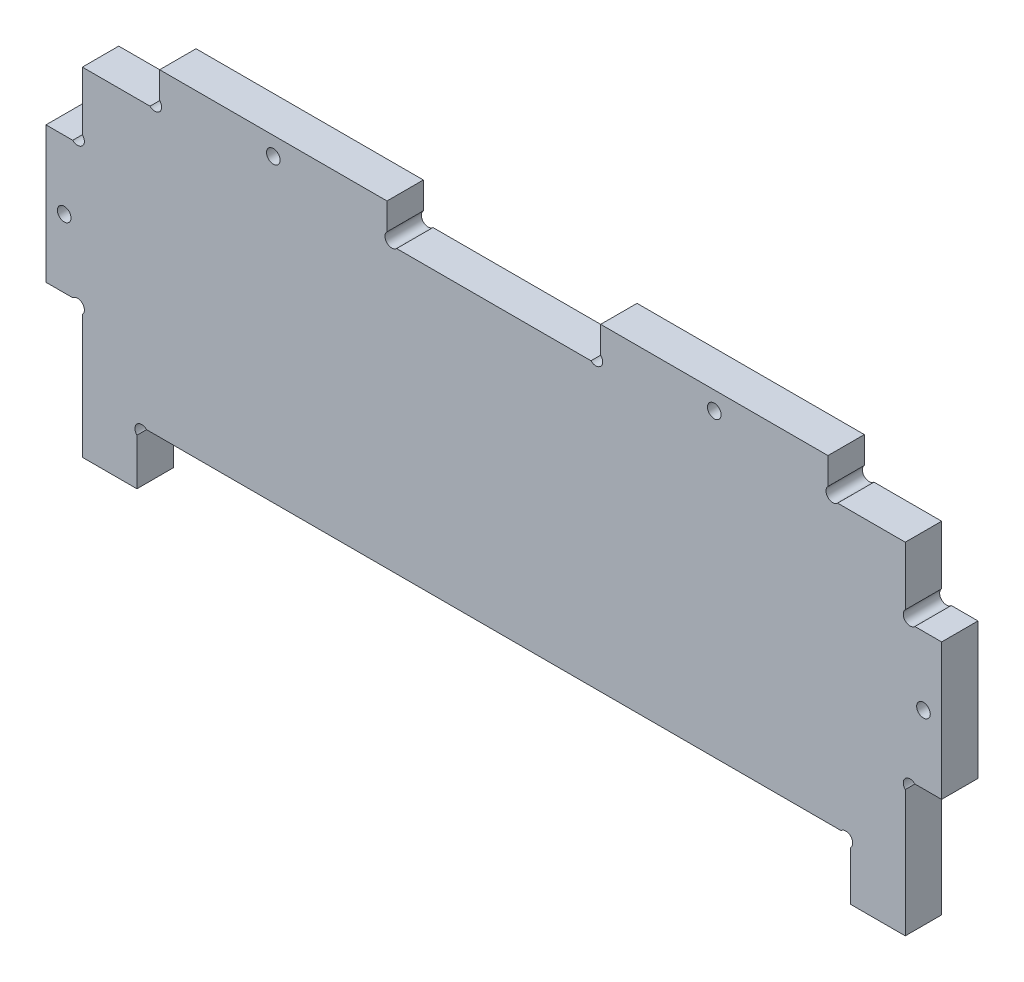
from build123d import *

# Parameters (mm, degrees)
ESQUISSE1_R        = 1.5
BOSS_EXTRU_1_DEPTH = 8


with BuildPart() as part:
    # Esquisse1 → Boss.-Extru.1 (new body)
    with BuildSketch(Plane.XY):
        with BuildLine():
            Line((-38.164401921, 25.463289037), (-23.285722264, 25.463289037))
            ThreePointArc((-23.285722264, 25.463289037), (-21.164401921, 25.463289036), (-21.16440192, 27.584609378))
            Line((-21.16440192, 27.584609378), (-21.16440192, 33.463289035))
            Line((-21.16440192, 33.463289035), (28.83559808, 33.463289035))
            Line((28.83559808, 33.463289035), (28.83559808, 27.584609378))
            ThreePointArc((28.83559808, 27.584609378), (28.83559808, 25.463289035), (30.956918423, 25.463289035))
            Line((30.956918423, 25.463289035), (73.714277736, 25.463289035))
            ThreePointArc((73.714277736, 25.463289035), (75.835598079, 25.463289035), (75.835598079, 27.584609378))
            Line((75.835598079, 27.584609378), (75.835598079, 33.463289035))
            Line((75.835598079, 33.463289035), (125.835598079, 33.463289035))
            Line((125.835598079, 33.463289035), (125.835598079, 27.584609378))
            ThreePointArc((125.835598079, 27.584609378), (125.83559808, 25.463289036), (127.956918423, 25.463289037))
            Line((127.956918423, 25.463289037), (142.835598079, 25.463289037))
            Line((142.835598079, 25.463289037), (142.835598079, 13.023949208))
            Line((142.835598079, 13.023949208), (142.835598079, 12.58460938))
            ThreePointArc((142.835598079, 12.58460938), (142.83559808, 10.463289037), (144.956918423, 10.463289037))
            Line((144.956918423, 10.463289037), (150.835598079, 10.463289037))
            Line((150.835598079, 10.463289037), (150.835598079, -19.536710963))
            Line((150.835598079, -19.536710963), (144.956918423, -19.536710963))
            ThreePointArc((144.956918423, -19.536710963), (142.835598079, -19.536710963), (142.835598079, -21.658031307))
            Line((142.835598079, -21.658031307), (142.835598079, -22.097371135))
            Line((142.835598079, -22.097371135), (142.835598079, -36.536710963))
            Line((142.835598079, -36.536710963), (142.835598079, -49.536710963))
            Line((142.835598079, -49.536710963), (130.835598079, -49.536710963))
            Line((130.835598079, -49.536710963), (130.835598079, -38.658031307))
            ThreePointArc((130.835598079, -38.658031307), (130.835598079, -36.536710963), (128.714277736, -36.536710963))
            Line((128.714277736, -36.536710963), (-24.043081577, -36.536710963))
            ThreePointArc((-24.043081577, -36.536710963), (-26.16440192, -36.536710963), (-26.16440192, -38.658031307))
            Line((-26.16440192, -38.658031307), (-26.16440192, -48.869271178))
            Line((-26.16440192, -48.869271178), (-38.16440192, -48.869271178))
            Line((-38.16440192, -48.869271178), (-38.16440192, -36.536710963))
            Line((-38.16440192, -36.536710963), (-38.16440192, -22.097371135))
            Line((-38.16440192, -22.097371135), (-38.16440192, -21.658031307))
            ThreePointArc((-38.16440192, -21.658031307), (-38.16440192, -19.536710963), (-40.285722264, -19.536710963))
            Line((-40.285722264, -19.536710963), (-46.164401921, -19.536710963))
            Line((-46.164401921, -19.536710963), (-46.164401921, 10.463289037))
            Line((-46.164401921, 10.463289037), (-40.285722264, 10.463289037))
            ThreePointArc((-40.285722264, 10.463289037), (-38.164401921, 10.463289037), (-38.164401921, 12.58460938))
            Line((-38.164401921, 12.58460938), (-38.164401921, 13.023949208))
            Line((-38.164401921, 13.023949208), (-38.164401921, 25.463289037))
        make_face()
        with Locations(Location((100.835598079, 29.463289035, 0), (0, 0, 180))):
            Circle(ESQUISSE1_R, mode=Mode.SUBTRACT)
        with Locations(Location((146.835598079, -4.536710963, 0), (0, 0, 180))):
            Circle(ESQUISSE1_R, mode=Mode.SUBTRACT)
        with Locations((-42.164401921, -4.536710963)):
            Circle(ESQUISSE1_R, mode=Mode.SUBTRACT)
        with Locations((3.83559808, 29.463289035)):
            Circle(ESQUISSE1_R, mode=Mode.SUBTRACT)
    extrude(amount=BOSS_EXTRU_1_DEPTH)


solid = part.part
